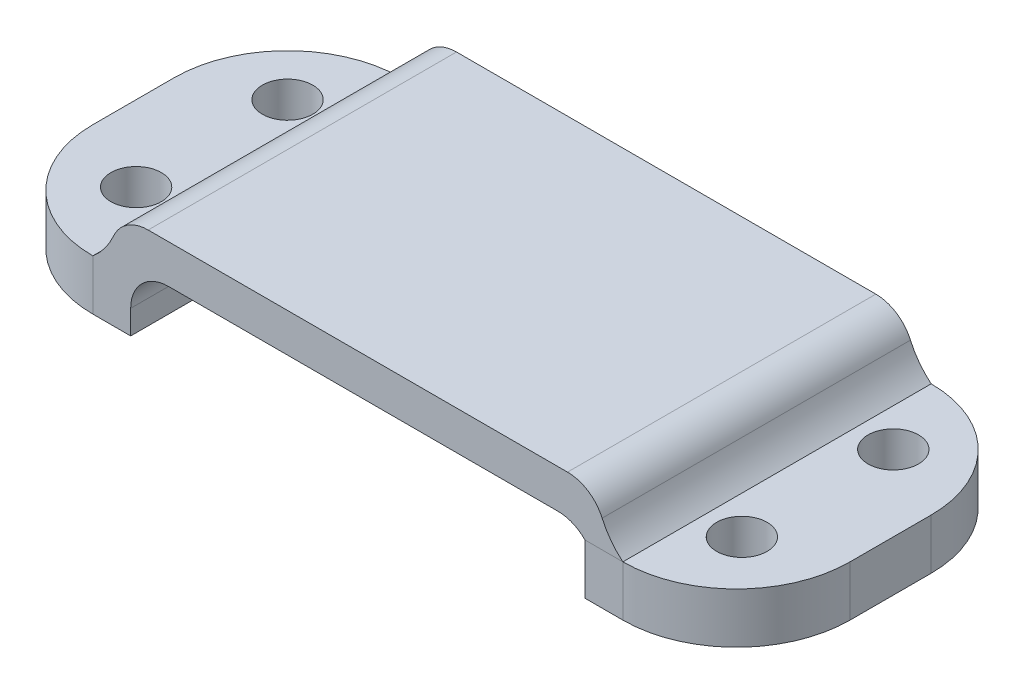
ISO-10303-21;
HEADER;
FILE_DESCRIPTION(('STEP AP214'),'2;1');
FILE_NAME('part.step','',(''),(''),'','','');
FILE_SCHEMA(('AUTOMOTIVE_DESIGN { 1 0 10303 214 1 1 1 1 }'));
ENDSEC;
DATA;
#1=APPLICATION_CONTEXT('core data for automotive mechanical design processes');
#2=APPLICATION_PROTOCOL_DEFINITION('international standard','automotive_design',2000,#1);
#3=PRODUCT_CONTEXT('',#1,'mechanical');
#4=PRODUCT('Part','Part','',(#3));
#5=PRODUCT_RELATED_PRODUCT_CATEGORY('part','',(#4));
#6=PRODUCT_DEFINITION_FORMATION('','',#4);
#7=PRODUCT_DEFINITION_CONTEXT('part definition',#1,'design');
#8=PRODUCT_DEFINITION('design','',#6,#7);
#9=PRODUCT_DEFINITION_SHAPE('','',#8);
#10=(LENGTH_UNIT() NAMED_UNIT(*) SI_UNIT(.MILLI.,.METRE.));
#11=(NAMED_UNIT(*) PLANE_ANGLE_UNIT() SI_UNIT($,.RADIAN.));
#12=(NAMED_UNIT(*) SI_UNIT($,.STERADIAN.) SOLID_ANGLE_UNIT());
#13=UNCERTAINTY_MEASURE_WITH_UNIT(LENGTH_MEASURE(1.E-05),#10,'distance_accuracy_value','');
#14=(GEOMETRIC_REPRESENTATION_CONTEXT(3) GLOBAL_UNCERTAINTY_ASSIGNED_CONTEXT((#13)) GLOBAL_UNIT_ASSIGNED_CONTEXT((#10,
#11,#12)) REPRESENTATION_CONTEXT('',''));
#15=CARTESIAN_POINT('',(0.,0.,0.));
#16=DIRECTION('',(0.,0.,1.));
#17=DIRECTION('',(1.,0.,0.));
#18=AXIS2_PLACEMENT_3D('',#15,#16,#17);
#19=CARTESIAN_POINT('',(0.,4.,-12.215));
#20=DIRECTION('',(0.,0.,1.));
#21=DIRECTION('',(1.,0.,0.));
#22=AXIS2_PLACEMENT_3D('',#19,#20,#21);
#23=PLANE('',#22);
#24=DIRECTION('',(-1.,0.,0.));
#25=VECTOR('',#24,1.);
#26=CARTESIAN_POINT('',(0.,4.,-12.215));
#27=LINE('',#26,#25);
#28=CARTESIAN_POINT('',(21.,4.,-12.215));
#29=VERTEX_POINT('',#28);
#30=CARTESIAN_POINT('',(18.,4.,-12.215));
#31=VERTEX_POINT('',#30);
#32=EDGE_CURVE('E110',#29,#31,#27,.T.);
#33=ORIENTED_EDGE('',*,*,#32,.F.);
#34=DIRECTION('',(0.,-1.,0.));
#35=VECTOR('',#34,1.);
#36=CARTESIAN_POINT('',(21.,4.,-12.215));
#37=LINE('',#36,#35);
#38=CARTESIAN_POINT('',(21.,0.,-12.215));
#39=VERTEX_POINT('',#38);
#40=EDGE_CURVE('E137',#29,#39,#37,.T.);
#41=ORIENTED_EDGE('',*,*,#40,.T.);
#42=DIRECTION('',(-1.,0.,0.));
#43=VECTOR('',#42,1.);
#44=CARTESIAN_POINT('',(0.,0.,-12.215));
#45=LINE('',#44,#43);
#46=CARTESIAN_POINT('',(18.,0.,-12.215));
#47=VERTEX_POINT('',#46);
#48=EDGE_CURVE('E134',#39,#47,#45,.T.);
#49=ORIENTED_EDGE('',*,*,#48,.T.);
#50=DIRECTION('',(0.,-1.,0.));
#51=VECTOR('',#50,1.);
#52=CARTESIAN_POINT('',(18.,4.,-12.215));
#53=LINE('',#52,#51);
#54=EDGE_CURVE('E127',#31,#47,#53,.T.);
#55=ORIENTED_EDGE('',*,*,#54,.F.);
#56=EDGE_LOOP('',(#33,#41,#49,#55));
#57=FACE_BOUND('',#56,.T.);
#58=ADVANCED_FACE('F55',(#57),#23,.F.);
#59=CARTESIAN_POINT('',(18.,4.,0.));
#60=DIRECTION('',(1.,0.,0.));
#61=DIRECTION('',(0.,0.,-1.));
#62=AXIS2_PLACEMENT_3D('',#59,#60,#61);
#63=PLANE('',#62);
#64=DIRECTION('',(0.,0.,1.));
#65=VECTOR('',#64,1.);
#66=CARTESIAN_POINT('',(18.,0.,0.));
#67=LINE('',#66,#65);
#68=CARTESIAN_POINT('',(18.,0.,12.215));
#69=VERTEX_POINT('',#68);
#70=EDGE_CURVE('E174',#47,#69,#67,.T.);
#71=ORIENTED_EDGE('',*,*,#70,.T.);
#72=DIRECTION('',(0.,-1.,0.));
#73=VECTOR('',#72,1.);
#74=CARTESIAN_POINT('',(18.,4.,12.215));
#75=LINE('',#74,#73);
#76=CARTESIAN_POINT('',(18.,4.,12.215));
#77=VERTEX_POINT('',#76);
#78=EDGE_CURVE('E129',#77,#69,#75,.T.);
#79=ORIENTED_EDGE('',*,*,#78,.F.);
#80=DIRECTION('',(0.,0.,1.));
#81=VECTOR('',#80,1.);
#82=CARTESIAN_POINT('',(18.,4.,0.));
#83=LINE('',#82,#81);
#84=EDGE_CURVE('E113',#31,#77,#83,.T.);
#85=ORIENTED_EDGE('',*,*,#84,.F.);
#86=ORIENTED_EDGE('',*,*,#54,.T.);
#87=EDGE_LOOP('',(#71,#79,#85,#86));
#88=FACE_BOUND('',#87,.T.);
#89=ADVANCED_FACE('F126',(#88),#63,.F.);
#90=CARTESIAN_POINT('',(0.,4.,12.215));
#91=DIRECTION('',(0.,0.,1.));
#92=DIRECTION('',(1.,0.,0.));
#93=AXIS2_PLACEMENT_3D('',#90,#91,#92);
#94=PLANE('',#93);
#95=DIRECTION('',(-1.,0.,0.));
#96=VECTOR('',#95,1.);
#97=CARTESIAN_POINT('',(0.,0.,12.215));
#98=LINE('',#97,#96);
#99=CARTESIAN_POINT('',(21.,0.,12.215));
#100=VERTEX_POINT('',#99);
#101=EDGE_CURVE('E164',#100,#69,#98,.T.);
#102=ORIENTED_EDGE('',*,*,#101,.F.);
#103=DIRECTION('',(0.,-1.,0.));
#104=VECTOR('',#103,1.);
#105=CARTESIAN_POINT('',(21.,4.,12.215));
#106=LINE('',#105,#104);
#107=CARTESIAN_POINT('',(21.,4.,12.215));
#108=VERTEX_POINT('',#107);
#109=EDGE_CURVE('E12',#100,#108,#106,.F.);
#110=ORIENTED_EDGE('',*,*,#109,.T.);
#111=DIRECTION('',(-1.,0.,0.));
#112=VECTOR('',#111,1.);
#113=CARTESIAN_POINT('',(0.,4.,12.215));
#114=LINE('',#113,#112);
#115=EDGE_CURVE('E131',#108,#77,#114,.T.);
#116=ORIENTED_EDGE('',*,*,#115,.T.);
#117=ORIENTED_EDGE('',*,*,#78,.T.);
#118=EDGE_LOOP('',(#102,#110,#116,#117));
#119=FACE_BOUND('',#118,.T.);
#120=ADVANCED_FACE('F193',(#119),#94,.T.);
#121=CARTESIAN_POINT('',(30.,4.,0.));
#122=DIRECTION('',(-1.,0.,0.));
#123=DIRECTION('',(0.,0.,1.));
#124=AXIS2_PLACEMENT_3D('',#121,#122,#123);
#125=PLANE('',#124);
#126=DIRECTION('',(0.,0.,-1.));
#127=VECTOR('',#126,1.);
#128=CARTESIAN_POINT('',(30.,0.,0.));
#129=LINE('',#128,#127);
#130=CARTESIAN_POINT('',(30.,0.,3.215));
#131=VERTEX_POINT('',#130);
#132=CARTESIAN_POINT('',(30.,0.,-3.215));
#133=VERTEX_POINT('',#132);
#134=EDGE_CURVE('E121',#131,#133,#129,.T.);
#135=ORIENTED_EDGE('',*,*,#134,.T.);
#136=DIRECTION('',(0.,-1.,0.));
#137=VECTOR('',#136,1.);
#138=CARTESIAN_POINT('',(30.,4.,-3.215));
#139=LINE('',#138,#137);
#140=CARTESIAN_POINT('',(30.,4.,-3.215));
#141=VERTEX_POINT('',#140);
#142=EDGE_CURVE('E77',#133,#141,#139,.F.);
#143=ORIENTED_EDGE('',*,*,#142,.T.);
#144=DIRECTION('',(0.,0.,-1.));
#145=VECTOR('',#144,1.);
#146=CARTESIAN_POINT('',(30.,4.,0.));
#147=LINE('',#146,#145);
#148=CARTESIAN_POINT('',(30.,4.,3.215));
#149=VERTEX_POINT('',#148);
#150=EDGE_CURVE('E144',#149,#141,#147,.T.);
#151=ORIENTED_EDGE('',*,*,#150,.F.);
#152=DIRECTION('',(0.,-1.,0.));
#153=VECTOR('',#152,1.);
#154=CARTESIAN_POINT('',(30.,0.,3.215));
#155=LINE('',#154,#153);
#156=EDGE_CURVE('E153',#149,#131,#155,.T.);
#157=ORIENTED_EDGE('',*,*,#156,.T.);
#158=EDGE_LOOP('',(#135,#143,#151,#157));
#159=FACE_BOUND('',#158,.T.);
#160=ADVANCED_FACE('F197',(#159),#125,.F.);
#161=CARTESIAN_POINT('',(0.,4.,0.));
#162=DIRECTION('',(0.,1.,0.));
#163=DIRECTION('',(0.,0.,1.));
#164=AXIS2_PLACEMENT_3D('',#161,#162,#163);
#165=PLANE('',#164);
#166=CARTESIAN_POINT('',(24.,4.,-6.21499999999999));
#167=DIRECTION('',(0.,1.,0.));
#168=DIRECTION('',(0.,0.,1.));
#169=AXIS2_PLACEMENT_3D('',#166,#167,#168);
#170=CIRCLE('',#169,2.);
#171=CARTESIAN_POINT('',(24.,4.,-4.21499999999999));
#172=VERTEX_POINT('',#171);
#173=EDGE_CURVE('E168',#172,#172,#170,.T.);
#174=ORIENTED_EDGE('',*,*,#173,.F.);
#175=EDGE_LOOP('',(#174));
#176=FACE_BOUND('',#175,.T.);
#177=CARTESIAN_POINT('',(24.0000000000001,4.,5.78500000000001));
#178=DIRECTION('',(0.,1.,0.));
#179=DIRECTION('',(0.,0.,1.));
#180=AXIS2_PLACEMENT_3D('',#177,#178,#179);
#181=CIRCLE('',#180,2.);
#182=CARTESIAN_POINT('',(24.0000000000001,4.,7.78500000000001));
#183=VERTEX_POINT('',#182);
#184=EDGE_CURVE('E178',#183,#183,#181,.T.);
#185=ORIENTED_EDGE('',*,*,#184,.F.);
#186=EDGE_LOOP('',(#185));
#187=FACE_BOUND('',#186,.T.);
#188=ORIENTED_EDGE('',*,*,#150,.T.);
#189=CARTESIAN_POINT('',(21.,4.,-3.215));
#190=DIRECTION('',(0.,1.,0.));
#191=DIRECTION('',(0.,0.,1.));
#192=AXIS2_PLACEMENT_3D('',#189,#190,#191);
#193=CIRCLE('',#192,9.);
#194=EDGE_CURVE('E64',#141,#29,#193,.T.);
#195=ORIENTED_EDGE('',*,*,#194,.T.);
#196=ORIENTED_EDGE('',*,*,#32,.T.);
#197=ORIENTED_EDGE('',*,*,#84,.T.);
#198=ORIENTED_EDGE('',*,*,#115,.F.);
#199=CARTESIAN_POINT('',(21.,4.,3.215));
#200=DIRECTION('',(0.,1.,0.));
#201=DIRECTION('',(0.,0.,1.));
#202=AXIS2_PLACEMENT_3D('',#199,#200,#201);
#203=CIRCLE('',#202,9.);
#204=EDGE_CURVE('E159',#108,#149,#203,.T.);
#205=ORIENTED_EDGE('',*,*,#204,.T.);
#206=EDGE_LOOP('',(#188,#195,#196,#197,#198,#205));
#207=FACE_BOUND('',#206,.T.);
#208=ADVANCED_FACE('F112',(#176,#187,#207),#165,.T.);
#209=CARTESIAN_POINT('',(0.,0.,0.));
#210=DIRECTION('',(0.,1.,0.));
#211=DIRECTION('',(0.,0.,1.));
#212=AXIS2_PLACEMENT_3D('',#209,#210,#211);
#213=PLANE('',#212);
#214=CARTESIAN_POINT('',(24.,0.,-6.21499999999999));
#215=DIRECTION('',(0.,1.,0.));
#216=DIRECTION('',(0.,0.,1.));
#217=AXIS2_PLACEMENT_3D('',#214,#215,#216);
#218=CIRCLE('',#217,2.);
#219=CARTESIAN_POINT('',(24.,0.,-4.21499999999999));
#220=VERTEX_POINT('',#219);
#221=EDGE_CURVE('E170',#220,#220,#218,.T.);
#222=ORIENTED_EDGE('',*,*,#221,.T.);
#223=EDGE_LOOP('',(#222));
#224=FACE_BOUND('',#223,.T.);
#225=CARTESIAN_POINT('',(24.0000000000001,0.,5.78500000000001));
#226=DIRECTION('',(0.,1.,0.));
#227=DIRECTION('',(0.,0.,1.));
#228=AXIS2_PLACEMENT_3D('',#225,#226,#227);
#229=CIRCLE('',#228,2.);
#230=CARTESIAN_POINT('',(24.0000000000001,0.,7.78500000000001));
#231=VERTEX_POINT('',#230);
#232=EDGE_CURVE('E171',#231,#231,#229,.T.);
#233=ORIENTED_EDGE('',*,*,#232,.T.);
#234=EDGE_LOOP('',(#233));
#235=FACE_BOUND('',#234,.T.);
#236=ORIENTED_EDGE('',*,*,#48,.F.);
#237=CARTESIAN_POINT('',(21.,0.,-3.215));
#238=DIRECTION('',(0.,1.,0.));
#239=DIRECTION('',(0.,0.,1.));
#240=AXIS2_PLACEMENT_3D('',#237,#238,#239);
#241=CIRCLE('',#240,9.);
#242=EDGE_CURVE('E150',#39,#133,#241,.F.);
#243=ORIENTED_EDGE('',*,*,#242,.T.);
#244=ORIENTED_EDGE('',*,*,#134,.F.);
#245=CARTESIAN_POINT('',(21.,0.,3.215));
#246=DIRECTION('',(0.,1.,0.));
#247=DIRECTION('',(0.,0.,1.));
#248=AXIS2_PLACEMENT_3D('',#245,#246,#247);
#249=CIRCLE('',#248,9.);
#250=EDGE_CURVE('E141',#131,#100,#249,.F.);
#251=ORIENTED_EDGE('',*,*,#250,.T.);
#252=ORIENTED_EDGE('',*,*,#101,.T.);
#253=ORIENTED_EDGE('',*,*,#70,.F.);
#254=EDGE_LOOP('',(#236,#243,#244,#251,#252,#253));
#255=FACE_BOUND('',#254,.T.);
#256=ADVANCED_FACE('F191',(#224,#235,#255),#213,.F.);
#257=CARTESIAN_POINT('',(24.0000000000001,0.,5.78500000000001));
#258=DIRECTION('',(0.,1.,0.));
#259=DIRECTION('',(0.,0.,1.));
#260=AXIS2_PLACEMENT_3D('',#257,#258,#259);
#261=CYLINDRICAL_SURFACE('',#260,2.);
#262=ORIENTED_EDGE('',*,*,#232,.F.);
#263=EDGE_LOOP('',(#262));
#264=FACE_BOUND('',#263,.T.);
#265=ORIENTED_EDGE('',*,*,#184,.T.);
#266=EDGE_LOOP('',(#265));
#267=FACE_BOUND('',#266,.T.);
#268=ADVANCED_FACE('F206',(#264,#267),#261,.F.);
#269=CARTESIAN_POINT('',(24.,0.,-6.21499999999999));
#270=DIRECTION('',(0.,1.,0.));
#271=DIRECTION('',(0.,0.,1.));
#272=AXIS2_PLACEMENT_3D('',#269,#270,#271);
#273=CYLINDRICAL_SURFACE('',#272,2.);
#274=ORIENTED_EDGE('',*,*,#221,.F.);
#275=EDGE_LOOP('',(#274));
#276=FACE_BOUND('',#275,.T.);
#277=ORIENTED_EDGE('',*,*,#173,.T.);
#278=EDGE_LOOP('',(#277));
#279=FACE_BOUND('',#278,.T.);
#280=ADVANCED_FACE('F201',(#276,#279),#273,.F.);
#281=CARTESIAN_POINT('',(21.,4.,-3.215));
#282=DIRECTION('',(0.,-1.,0.));
#283=DIRECTION('',(0.,0.,-1.));
#284=AXIS2_PLACEMENT_3D('',#281,#282,#283);
#285=CYLINDRICAL_SURFACE('',#284,9.);
#286=ORIENTED_EDGE('',*,*,#194,.F.);
#287=ORIENTED_EDGE('',*,*,#142,.F.);
#288=ORIENTED_EDGE('',*,*,#242,.F.);
#289=ORIENTED_EDGE('',*,*,#40,.F.);
#290=EDGE_LOOP('',(#286,#287,#288,#289));
#291=FACE_BOUND('',#290,.T.);
#292=ADVANCED_FACE('F199',(#291),#285,.T.);
#293=CARTESIAN_POINT('',(21.,4.,3.215));
#294=DIRECTION('',(0.,1.,0.));
#295=DIRECTION('',(0.,0.,1.));
#296=AXIS2_PLACEMENT_3D('',#293,#294,#295);
#297=CYLINDRICAL_SURFACE('',#296,9.);
#298=ORIENTED_EDGE('',*,*,#204,.F.);
#299=ORIENTED_EDGE('',*,*,#109,.F.);
#300=ORIENTED_EDGE('',*,*,#250,.F.);
#301=ORIENTED_EDGE('',*,*,#156,.F.);
#302=EDGE_LOOP('',(#298,#299,#300,#301));
#303=FACE_BOUND('',#302,.T.);
#304=ADVANCED_FACE('F57',(#303),#297,.T.);
#305=CLOSED_SHELL('',(#58,#89,#120,#160,#208,#256,#268,#280,#292,#304));
#306=MANIFOLD_SOLID_BREP('B2',#305);
#307=CARTESIAN_POINT('',(0.,4.,0.));
#308=DIRECTION('',(0.,1.,0.));
#309=DIRECTION('',(0.,0.,1.));
#310=AXIS2_PLACEMENT_3D('',#307,#308,#309);
#311=PLANE('',#310);
#312=CARTESIAN_POINT('',(-24.,4.,-6.21499999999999));
#313=DIRECTION('',(0.,1.,0.));
#314=DIRECTION('',(0.,0.,1.));
#315=AXIS2_PLACEMENT_3D('',#312,#313,#314);
#316=CIRCLE('',#315,2.);
#317=CARTESIAN_POINT('',(-24.,4.,-4.21499999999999));
#318=VERTEX_POINT('',#317);
#319=EDGE_CURVE('E473',#318,#318,#316,.T.);
#320=ORIENTED_EDGE('',*,*,#319,.F.);
#321=EDGE_LOOP('',(#320));
#322=FACE_BOUND('',#321,.T.);
#323=CARTESIAN_POINT('',(-23.9999999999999,4.,5.78500000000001));
#324=DIRECTION('',(0.,1.,0.));
#325=DIRECTION('',(0.,0.,1.));
#326=AXIS2_PLACEMENT_3D('',#323,#324,#325);
#327=CIRCLE('',#326,2.);
#328=CARTESIAN_POINT('',(-23.9999999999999,4.,7.78500000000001));
#329=VERTEX_POINT('',#328);
#330=EDGE_CURVE('E461',#329,#329,#327,.T.);
#331=ORIENTED_EDGE('',*,*,#330,.F.);
#332=EDGE_LOOP('',(#331));
#333=FACE_BOUND('',#332,.T.);
#334=CARTESIAN_POINT('',(-21.,4.,3.21499999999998));
#335=DIRECTION('',(0.,1.,0.));
#336=DIRECTION('',(0.,0.,1.));
#337=AXIS2_PLACEMENT_3D('',#334,#335,#336);
#338=CIRCLE('',#337,9.);
#339=CARTESIAN_POINT('',(-30.,4.,3.21499999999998));
#340=VERTEX_POINT('',#339);
#341=CARTESIAN_POINT('',(-21.,4.,12.215));
#342=VERTEX_POINT('',#341);
#343=EDGE_CURVE('E529',#340,#342,#338,.T.);
#344=ORIENTED_EDGE('',*,*,#343,.T.);
#345=DIRECTION('',(0.,0.,-1.));
#346=VECTOR('',#345,1.);
#347=CARTESIAN_POINT('',(-21.,4.,33.5861188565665));
#348=LINE('',#347,#346);
#349=CARTESIAN_POINT('',(-21.,4.,-12.215));
#350=VERTEX_POINT('',#349);
#351=EDGE_CURVE('E452',#342,#350,#348,.T.);
#352=ORIENTED_EDGE('',*,*,#351,.T.);
#353=CARTESIAN_POINT('',(-21.,4.,-3.21499999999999));
#354=DIRECTION('',(0.,1.,0.));
#355=DIRECTION('',(0.,0.,1.));
#356=AXIS2_PLACEMENT_3D('',#353,#354,#355);
#357=CIRCLE('',#356,9.);
#358=CARTESIAN_POINT('',(-30.,4.,-3.21499999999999));
#359=VERTEX_POINT('',#358);
#360=EDGE_CURVE('E526',#350,#359,#357,.T.);
#361=ORIENTED_EDGE('',*,*,#360,.T.);
#362=DIRECTION('',(0.,0.,-1.));
#363=VECTOR('',#362,1.);
#364=CARTESIAN_POINT('',(-30.,4.,0.));
#365=LINE('',#364,#363);
#366=EDGE_CURVE('E484',#340,#359,#365,.T.);
#367=ORIENTED_EDGE('',*,*,#366,.F.);
#368=EDGE_LOOP('',(#344,#352,#361,#367));
#369=FACE_BOUND('',#368,.T.);
#370=ADVANCED_FACE('F314',(#322,#333,#369),#311,.T.);
#371=CARTESIAN_POINT('',(-18.,4.,0.));
#372=DIRECTION('',(1.,0.,0.));
#373=DIRECTION('',(0.,0.,-1.));
#374=AXIS2_PLACEMENT_3D('',#371,#372,#373);
#375=PLANE('',#374);
#376=DIRECTION('',(0.,-1.,0.));
#377=VECTOR('',#376,1.);
#378=CARTESIAN_POINT('',(-18.,4.,-12.215));
#379=LINE('',#378,#377);
#380=CARTESIAN_POINT('',(-18.,1.9,-12.215));
#381=VERTEX_POINT('',#380);
#382=CARTESIAN_POINT('',(-18.,0.,-12.215));
#383=VERTEX_POINT('',#382);
#384=EDGE_CURVE('E506',#381,#383,#379,.T.);
#385=ORIENTED_EDGE('',*,*,#384,.F.);
#386=DIRECTION('',(0.,0.,-1.));
#387=VECTOR('',#386,1.);
#388=CARTESIAN_POINT('',(-18.,1.9,0.));
#389=LINE('',#388,#387);
#390=CARTESIAN_POINT('',(-18.,1.9,12.215));
#391=VERTEX_POINT('',#390);
#392=EDGE_CURVE('E561',#381,#391,#389,.F.);
#393=ORIENTED_EDGE('',*,*,#392,.T.);
#394=DIRECTION('',(0.,-1.,0.));
#395=VECTOR('',#394,1.);
#396=CARTESIAN_POINT('',(-18.,4.,12.215));
#397=LINE('',#396,#395);
#398=CARTESIAN_POINT('',(-18.,0.,12.215));
#399=VERTEX_POINT('',#398);
#400=EDGE_CURVE('E488',#391,#399,#397,.T.);
#401=ORIENTED_EDGE('',*,*,#400,.T.);
#402=DIRECTION('',(0.,0.,1.));
#403=VECTOR('',#402,1.);
#404=CARTESIAN_POINT('',(-18.,0.,0.));
#405=LINE('',#404,#403);
#406=EDGE_CURVE('E472',#383,#399,#405,.T.);
#407=ORIENTED_EDGE('',*,*,#406,.F.);
#408=EDGE_LOOP('',(#385,#393,#401,#407));
#409=FACE_BOUND('',#408,.T.);
#410=ADVANCED_FACE('F648',(#409),#375,.T.);
#411=CARTESIAN_POINT('',(0.,4.,-12.215));
#412=DIRECTION('',(0.,0.,1.));
#413=DIRECTION('',(1.,0.,0.));
#414=AXIS2_PLACEMENT_3D('',#411,#412,#413);
#415=PLANE('',#414);
#416=DIRECTION('',(-1.,0.,0.));
#417=VECTOR('',#416,1.);
#418=CARTESIAN_POINT('',(0.,7.96544085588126,-12.215));
#419=LINE('',#418,#417);
#420=CARTESIAN_POINT('',(16.6146747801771,7.96544085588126,-12.215));
#421=VERTEX_POINT('',#420);
#422=CARTESIAN_POINT('',(-16.6146747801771,7.96544085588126,-12.215));
#423=VERTEX_POINT('',#422);
#424=EDGE_CURVE('E453',#421,#423,#419,.T.);
#425=ORIENTED_EDGE('',*,*,#424,.F.);
#426=CARTESIAN_POINT('',(16.6146747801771,4.96544085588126,-12.215));
#427=DIRECTION('',(0.,0.,1.));
#428=DIRECTION('',(1.,0.,0.));
#429=AXIS2_PLACEMENT_3D('',#426,#427,#428);
#430=CIRCLE('',#429,3.);
#431=CARTESIAN_POINT('',(19.3583570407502,6.17878650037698,-12.215));
#432=VERTEX_POINT('',#431);
#433=EDGE_CURVE('E419',#421,#432,#430,.F.);
#434=ORIENTED_EDGE('',*,*,#433,.T.);
#435=CARTESIAN_POINT('',(24.8457215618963,8.60547778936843,-12.215));
#436=DIRECTION('',(0.,0.,1.));
#437=DIRECTION('',(1.,0.,0.));
#438=AXIS2_PLACEMENT_3D('',#435,#436,#437);
#439=CIRCLE('',#438,6.);
#440=CARTESIAN_POINT('',(21.,4.,-12.215));
#441=VERTEX_POINT('',#440);
#442=EDGE_CURVE('E414',#432,#441,#439,.T.);
#443=ORIENTED_EDGE('',*,*,#442,.T.);
#444=DIRECTION('',(-1.,0.,0.));
#445=VECTOR('',#444,1.);
#446=CARTESIAN_POINT('',(0.,4.,-12.215));
#447=LINE('',#446,#445);
#448=CARTESIAN_POINT('',(18.,4.,-12.215));
#449=VERTEX_POINT('',#448);
#450=EDGE_CURVE('E418',#441,#449,#447,.T.);
#451=ORIENTED_EDGE('',*,*,#450,.T.);
#452=CARTESIAN_POINT('',(15.8575714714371,1.9,-12.215));
#453=DIRECTION('',(0.,0.,1.));
#454=DIRECTION('',(1.,0.,0.));
#455=AXIS2_PLACEMENT_3D('',#452,#453,#454);
#456=CIRCLE('',#455,3.);
#457=CARTESIAN_POINT('',(15.8575714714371,4.9,-12.215));
#458=VERTEX_POINT('',#457);
#459=EDGE_CURVE('E564',#449,#458,#456,.T.);
#460=ORIENTED_EDGE('',*,*,#459,.T.);
#461=DIRECTION('',(-1.,0.,0.));
#462=VECTOR('',#461,1.);
#463=CARTESIAN_POINT('',(0.,4.9,-12.215));
#464=LINE('',#463,#462);
#465=CARTESIAN_POINT('',(-15.,4.9,-12.215));
#466=VERTEX_POINT('',#465);
#467=EDGE_CURVE('E449',#458,#466,#464,.T.);
#468=ORIENTED_EDGE('',*,*,#467,.T.);
#469=CARTESIAN_POINT('',(-15.,1.9,-12.215));
#470=DIRECTION('',(0.,0.,1.));
#471=DIRECTION('',(1.,0.,0.));
#472=AXIS2_PLACEMENT_3D('',#469,#470,#471);
#473=CIRCLE('',#472,3.);
#474=EDGE_CURVE('E570',#466,#381,#473,.T.);
#475=ORIENTED_EDGE('',*,*,#474,.T.);
#476=ORIENTED_EDGE('',*,*,#384,.T.);
#477=DIRECTION('',(-1.,0.,0.));
#478=VECTOR('',#477,1.);
#479=CARTESIAN_POINT('',(0.,0.,-12.215));
#480=LINE('',#479,#478);
#481=CARTESIAN_POINT('',(-21.,0.,-12.215));
#482=VERTEX_POINT('',#481);
#483=EDGE_CURVE('E493',#383,#482,#480,.T.);
#484=ORIENTED_EDGE('',*,*,#483,.T.);
#485=DIRECTION('',(0.,-1.,0.));
#486=VECTOR('',#485,1.);
#487=CARTESIAN_POINT('',(-21.,4.,-12.215));
#488=LINE('',#487,#486);
#489=EDGE_CURVE('E533',#482,#350,#488,.F.);
#490=ORIENTED_EDGE('',*,*,#489,.T.);
#491=CARTESIAN_POINT('',(-24.8457215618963,8.60547778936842,-12.215));
#492=DIRECTION('',(0.,0.,1.));
#493=DIRECTION('',(1.,0.,0.));
#494=AXIS2_PLACEMENT_3D('',#491,#492,#493);
#495=CIRCLE('',#494,6.);
#496=CARTESIAN_POINT('',(-19.3583570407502,6.17878650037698,-12.215));
#497=VERTEX_POINT('',#496);
#498=EDGE_CURVE('E323',#350,#497,#495,.T.);
#499=ORIENTED_EDGE('',*,*,#498,.T.);
#500=CARTESIAN_POINT('',(-16.6146747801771,4.96544085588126,-12.215));
#501=DIRECTION('',(0.,0.,1.));
#502=DIRECTION('',(1.,0.,0.));
#503=AXIS2_PLACEMENT_3D('',#500,#501,#502);
#504=CIRCLE('',#503,3.);
#505=EDGE_CURVE('E543',#497,#423,#504,.F.);
#506=ORIENTED_EDGE('',*,*,#505,.T.);
#507=EDGE_LOOP('',(#425,#434,#443,#451,#460,#468,#475,#476,#484,#490,#499,#506));
#508=FACE_BOUND('',#507,.T.);
#509=ADVANCED_FACE('F417',(#508),#415,.F.);
#510=CARTESIAN_POINT('',(-30.,4.,0.));
#511=DIRECTION('',(-1.,0.,0.));
#512=DIRECTION('',(0.,0.,1.));
#513=AXIS2_PLACEMENT_3D('',#510,#511,#512);
#514=PLANE('',#513);
#515=DIRECTION('',(0.,0.,-1.));
#516=VECTOR('',#515,1.);
#517=CARTESIAN_POINT('',(-30.,0.,0.));
#518=LINE('',#517,#516);
#519=CARTESIAN_POINT('',(-30.,0.,3.21499999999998));
#520=VERTEX_POINT('',#519);
#521=CARTESIAN_POINT('',(-30.,0.,-3.21499999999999));
#522=VERTEX_POINT('',#521);
#523=EDGE_CURVE('E497',#520,#522,#518,.T.);
#524=ORIENTED_EDGE('',*,*,#523,.F.);
#525=DIRECTION('',(0.,-1.,0.));
#526=VECTOR('',#525,1.);
#527=CARTESIAN_POINT('',(-30.,4.,3.21499999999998));
#528=LINE('',#527,#526);
#529=EDGE_CURVE('E523',#520,#340,#528,.F.);
#530=ORIENTED_EDGE('',*,*,#529,.T.);
#531=ORIENTED_EDGE('',*,*,#366,.T.);
#532=DIRECTION('',(0.,-1.,0.));
#533=VECTOR('',#532,1.);
#534=CARTESIAN_POINT('',(-30.,0.,-3.21499999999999));
#535=LINE('',#534,#533);
#536=EDGE_CURVE('E519',#359,#522,#535,.T.);
#537=ORIENTED_EDGE('',*,*,#536,.T.);
#538=EDGE_LOOP('',(#524,#530,#531,#537));
#539=FACE_BOUND('',#538,.T.);
#540=ADVANCED_FACE('F664',(#539),#514,.T.);
#541=CARTESIAN_POINT('',(0.,4.,12.215));
#542=DIRECTION('',(0.,0.,-1.));
#543=DIRECTION('',(-1.,0.,0.));
#544=AXIS2_PLACEMENT_3D('',#541,#542,#543);
#545=PLANE('',#544);
#546=DIRECTION('',(-1.,0.,0.));
#547=VECTOR('',#546,1.);
#548=CARTESIAN_POINT('',(0.,4.,12.215));
#549=LINE('',#548,#547);
#550=CARTESIAN_POINT('',(21.,4.,12.215));
#551=VERTEX_POINT('',#550);
#552=CARTESIAN_POINT('',(18.,4.,12.215));
#553=VERTEX_POINT('',#552);
#554=EDGE_CURVE('E445',#551,#553,#549,.T.);
#555=ORIENTED_EDGE('',*,*,#554,.F.);
#556=CARTESIAN_POINT('',(24.8457215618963,8.60547778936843,12.215));
#557=DIRECTION('',(0.,0.,-1.));
#558=DIRECTION('',(-1.,0.,0.));
#559=AXIS2_PLACEMENT_3D('',#556,#557,#558);
#560=CIRCLE('',#559,6.);
#561=CARTESIAN_POINT('',(19.3583570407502,6.17878650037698,12.215));
#562=VERTEX_POINT('',#561);
#563=EDGE_CURVE('E425',#551,#562,#560,.T.);
#564=ORIENTED_EDGE('',*,*,#563,.T.);
#565=CARTESIAN_POINT('',(16.6146747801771,4.96544085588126,12.215));
#566=DIRECTION('',(0.,0.,-1.));
#567=DIRECTION('',(-1.,0.,0.));
#568=AXIS2_PLACEMENT_3D('',#565,#566,#567);
#569=CIRCLE('',#568,3.);
#570=CARTESIAN_POINT('',(16.6146747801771,7.96544085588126,12.215));
#571=VERTEX_POINT('',#570);
#572=EDGE_CURVE('E551',#562,#571,#569,.F.);
#573=ORIENTED_EDGE('',*,*,#572,.T.);
#574=DIRECTION('',(-1.,0.,0.));
#575=VECTOR('',#574,1.);
#576=CARTESIAN_POINT('',(0.,7.96544085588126,12.215));
#577=LINE('',#576,#575);
#578=CARTESIAN_POINT('',(-16.6146747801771,7.96544085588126,12.215));
#579=VERTEX_POINT('',#578);
#580=EDGE_CURVE('E457',#571,#579,#577,.T.);
#581=ORIENTED_EDGE('',*,*,#580,.T.);
#582=CARTESIAN_POINT('',(-16.6146747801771,4.96544085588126,12.215));
#583=DIRECTION('',(0.,0.,-1.));
#584=DIRECTION('',(-1.,0.,0.));
#585=AXIS2_PLACEMENT_3D('',#582,#583,#584);
#586=CIRCLE('',#585,3.);
#587=CARTESIAN_POINT('',(-19.3583570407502,6.17878650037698,12.215));
#588=VERTEX_POINT('',#587);
#589=EDGE_CURVE('E548',#579,#588,#586,.F.);
#590=ORIENTED_EDGE('',*,*,#589,.T.);
#591=CARTESIAN_POINT('',(-24.8457215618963,8.60547778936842,12.215));
#592=DIRECTION('',(0.,0.,-1.));
#593=DIRECTION('',(-1.,0.,0.));
#594=AXIS2_PLACEMENT_3D('',#591,#592,#593);
#595=CIRCLE('',#594,6.);
#596=EDGE_CURVE('E53',#588,#342,#595,.T.);
#597=ORIENTED_EDGE('',*,*,#596,.T.);
#598=DIRECTION('',(0.,-1.,0.));
#599=VECTOR('',#598,1.);
#600=CARTESIAN_POINT('',(-21.,0.,12.215));
#601=LINE('',#600,#599);
#602=CARTESIAN_POINT('',(-21.,0.,12.215));
#603=VERTEX_POINT('',#602);
#604=EDGE_CURVE('E509',#342,#603,#601,.T.);
#605=ORIENTED_EDGE('',*,*,#604,.T.);
#606=DIRECTION('',(1.,0.,0.));
#607=VECTOR('',#606,1.);
#608=CARTESIAN_POINT('',(0.,0.,12.215));
#609=LINE('',#608,#607);
#610=EDGE_CURVE('E489',#603,#399,#609,.T.);
#611=ORIENTED_EDGE('',*,*,#610,.T.);
#612=ORIENTED_EDGE('',*,*,#400,.F.);
#613=CARTESIAN_POINT('',(-15.,1.9,12.215));
#614=DIRECTION('',(0.,0.,-1.));
#615=DIRECTION('',(-1.,0.,0.));
#616=AXIS2_PLACEMENT_3D('',#613,#614,#615);
#617=CIRCLE('',#616,3.);
#618=CARTESIAN_POINT('',(-15.,4.9,12.215));
#619=VERTEX_POINT('',#618);
#620=EDGE_CURVE('E573',#391,#619,#617,.T.);
#621=ORIENTED_EDGE('',*,*,#620,.T.);
#622=DIRECTION('',(-1.,0.,0.));
#623=VECTOR('',#622,1.);
#624=CARTESIAN_POINT('',(0.,4.9,12.215));
#625=LINE('',#624,#623);
#626=CARTESIAN_POINT('',(15.8575714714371,4.9,12.215));
#627=VERTEX_POINT('',#626);
#628=EDGE_CURVE('E462',#627,#619,#625,.T.);
#629=ORIENTED_EDGE('',*,*,#628,.F.);
#630=CARTESIAN_POINT('',(15.8575714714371,1.9,12.215));
#631=DIRECTION('',(0.,0.,-1.));
#632=DIRECTION('',(-1.,0.,0.));
#633=AXIS2_PLACEMENT_3D('',#630,#631,#632);
#634=CIRCLE('',#633,3.);
#635=EDGE_CURVE('E567',#627,#553,#634,.T.);
#636=ORIENTED_EDGE('',*,*,#635,.T.);
#637=EDGE_LOOP('',(#555,#564,#573,#581,#590,#597,#605,#611,#612,#621,#629,#636));
#638=FACE_BOUND('',#637,.T.);
#639=ADVANCED_FACE('F671',(#638),#545,.F.);
#640=CARTESIAN_POINT('',(0.,0.,0.));
#641=DIRECTION('',(0.,1.,0.));
#642=DIRECTION('',(0.,0.,1.));
#643=AXIS2_PLACEMENT_3D('',#640,#641,#642);
#644=PLANE('',#643);
#645=CARTESIAN_POINT('',(-24.,0.,-6.21499999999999));
#646=DIRECTION('',(0.,1.,0.));
#647=DIRECTION('',(0.,0.,1.));
#648=AXIS2_PLACEMENT_3D('',#645,#646,#647);
#649=CIRCLE('',#648,2.);
#650=CARTESIAN_POINT('',(-24.,0.,-4.21499999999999));
#651=VERTEX_POINT('',#650);
#652=EDGE_CURVE('E468',#651,#651,#649,.T.);
#653=ORIENTED_EDGE('',*,*,#652,.T.);
#654=EDGE_LOOP('',(#653));
#655=FACE_BOUND('',#654,.T.);
#656=CARTESIAN_POINT('',(-23.9999999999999,0.,5.78500000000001));
#657=DIRECTION('',(0.,1.,0.));
#658=DIRECTION('',(0.,0.,1.));
#659=AXIS2_PLACEMENT_3D('',#656,#657,#658);
#660=CIRCLE('',#659,2.);
#661=CARTESIAN_POINT('',(-23.9999999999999,0.,7.78500000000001));
#662=VERTEX_POINT('',#661);
#663=EDGE_CURVE('E477',#662,#662,#660,.T.);
#664=ORIENTED_EDGE('',*,*,#663,.T.);
#665=EDGE_LOOP('',(#664));
#666=FACE_BOUND('',#665,.T.);
#667=ORIENTED_EDGE('',*,*,#610,.F.);
#668=CARTESIAN_POINT('',(-21.,0.,3.21499999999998));
#669=DIRECTION('',(0.,1.,0.));
#670=DIRECTION('',(0.,0.,1.));
#671=AXIS2_PLACEMENT_3D('',#668,#669,#670);
#672=CIRCLE('',#671,9.);
#673=EDGE_CURVE('E516',#603,#520,#672,.F.);
#674=ORIENTED_EDGE('',*,*,#673,.T.);
#675=ORIENTED_EDGE('',*,*,#523,.T.);
#676=CARTESIAN_POINT('',(-21.,0.,-3.21499999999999));
#677=DIRECTION('',(0.,1.,0.));
#678=DIRECTION('',(0.,0.,1.));
#679=AXIS2_PLACEMENT_3D('',#676,#677,#678);
#680=CIRCLE('',#679,9.);
#681=EDGE_CURVE('E513',#522,#482,#680,.F.);
#682=ORIENTED_EDGE('',*,*,#681,.T.);
#683=ORIENTED_EDGE('',*,*,#483,.F.);
#684=ORIENTED_EDGE('',*,*,#406,.T.);
#685=EDGE_LOOP('',(#667,#674,#675,#682,#683,#684));
#686=FACE_BOUND('',#685,.T.);
#687=ADVANCED_FACE('F652',(#655,#666,#686),#644,.F.);
#688=CARTESIAN_POINT('',(-23.9999999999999,0.,5.78500000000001));
#689=DIRECTION('',(0.,1.,0.));
#690=DIRECTION('',(0.,0.,1.));
#691=AXIS2_PLACEMENT_3D('',#688,#689,#690);
#692=CYLINDRICAL_SURFACE('',#691,2.);
#693=ORIENTED_EDGE('',*,*,#663,.F.);
#694=EDGE_LOOP('',(#693));
#695=FACE_BOUND('',#694,.T.);
#696=ORIENTED_EDGE('',*,*,#330,.T.);
#697=EDGE_LOOP('',(#696));
#698=FACE_BOUND('',#697,.T.);
#699=ADVANCED_FACE('F701',(#695,#698),#692,.F.);
#700=CARTESIAN_POINT('',(-24.,0.,-6.21499999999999));
#701=DIRECTION('',(0.,1.,0.));
#702=DIRECTION('',(0.,0.,1.));
#703=AXIS2_PLACEMENT_3D('',#700,#701,#702);
#704=CYLINDRICAL_SURFACE('',#703,2.);
#705=ORIENTED_EDGE('',*,*,#652,.F.);
#706=EDGE_LOOP('',(#705));
#707=FACE_BOUND('',#706,.T.);
#708=ORIENTED_EDGE('',*,*,#319,.T.);
#709=EDGE_LOOP('',(#708));
#710=FACE_BOUND('',#709,.T.);
#711=ADVANCED_FACE('F713',(#707,#710),#704,.F.);
#712=CARTESIAN_POINT('',(-21.,4.,3.21499999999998));
#713=DIRECTION('',(0.,1.,0.));
#714=DIRECTION('',(0.,0.,1.));
#715=AXIS2_PLACEMENT_3D('',#712,#713,#714);
#716=CYLINDRICAL_SURFACE('',#715,9.);
#717=ORIENTED_EDGE('',*,*,#343,.F.);
#718=ORIENTED_EDGE('',*,*,#529,.F.);
#719=ORIENTED_EDGE('',*,*,#673,.F.);
#720=ORIENTED_EDGE('',*,*,#604,.F.);
#721=EDGE_LOOP('',(#717,#718,#719,#720));
#722=FACE_BOUND('',#721,.T.);
#723=ADVANCED_FACE('F667',(#722),#716,.T.);
#724=CARTESIAN_POINT('',(-21.,4.,-3.21499999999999));
#725=DIRECTION('',(0.,1.,0.));
#726=DIRECTION('',(0.,0.,1.));
#727=AXIS2_PLACEMENT_3D('',#724,#725,#726);
#728=CYLINDRICAL_SURFACE('',#727,9.);
#729=ORIENTED_EDGE('',*,*,#360,.F.);
#730=ORIENTED_EDGE('',*,*,#489,.F.);
#731=ORIENTED_EDGE('',*,*,#681,.F.);
#732=ORIENTED_EDGE('',*,*,#536,.F.);
#733=EDGE_LOOP('',(#729,#730,#731,#732));
#734=FACE_BOUND('',#733,.T.);
#735=ADVANCED_FACE('F656',(#734),#728,.T.);
#736=CARTESIAN_POINT('',(0.,4.9,33.5861188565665));
#737=DIRECTION('',(0.,1.,0.));
#738=DIRECTION('',(0.,0.,1.));
#739=AXIS2_PLACEMENT_3D('',#736,#737,#738);
#740=PLANE('',#739);
#741=ORIENTED_EDGE('',*,*,#467,.F.);
#742=DIRECTION('',(0.,0.,-1.));
#743=VECTOR('',#742,1.);
#744=CARTESIAN_POINT('',(15.8575714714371,4.9,33.5861188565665));
#745=LINE('',#744,#743);
#746=EDGE_CURVE('E558',#458,#627,#745,.F.);
#747=ORIENTED_EDGE('',*,*,#746,.T.);
#748=ORIENTED_EDGE('',*,*,#628,.T.);
#749=DIRECTION('',(0.,0.,-1.));
#750=VECTOR('',#749,1.);
#751=CARTESIAN_POINT('',(-15.,4.9,33.5861188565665));
#752=LINE('',#751,#750);
#753=EDGE_CURVE('E554',#619,#466,#752,.T.);
#754=ORIENTED_EDGE('',*,*,#753,.T.);
#755=EDGE_LOOP('',(#741,#747,#748,#754));
#756=FACE_BOUND('',#755,.T.);
#757=ADVANCED_FACE('F637',(#756),#740,.F.);
#758=CARTESIAN_POINT('',(0.,7.96544085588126,33.5861188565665));
#759=DIRECTION('',(0.,1.,0.));
#760=DIRECTION('',(0.,0.,1.));
#761=AXIS2_PLACEMENT_3D('',#758,#759,#760);
#762=PLANE('',#761);
#763=ORIENTED_EDGE('',*,*,#580,.F.);
#764=DIRECTION('',(0.,0.,-1.));
#765=VECTOR('',#764,1.);
#766=CARTESIAN_POINT('',(16.6146747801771,7.96544085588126,-12.215));
#767=LINE('',#766,#765);
#768=EDGE_CURVE('E539',#571,#421,#767,.T.);
#769=ORIENTED_EDGE('',*,*,#768,.T.);
#770=ORIENTED_EDGE('',*,*,#424,.T.);
#771=DIRECTION('',(0.,0.,-1.));
#772=VECTOR('',#771,1.);
#773=CARTESIAN_POINT('',(-16.6146747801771,7.96544085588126,33.5861188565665));
#774=LINE('',#773,#772);
#775=EDGE_CURVE('E536',#423,#579,#774,.F.);
#776=ORIENTED_EDGE('',*,*,#775,.T.);
#777=EDGE_LOOP('',(#763,#769,#770,#776));
#778=FACE_BOUND('',#777,.T.);
#779=ADVANCED_FACE('F676',(#778),#762,.T.);
#780=CARTESIAN_POINT('',(0.,4.,33.5861188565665));
#781=DIRECTION('',(0.,1.,0.));
#782=DIRECTION('',(0.,0.,1.));
#783=AXIS2_PLACEMENT_3D('',#780,#781,#782);
#784=PLANE('',#783);
#785=DIRECTION('',(0.,0.,-1.));
#786=VECTOR('',#785,1.);
#787=CARTESIAN_POINT('',(21.,4.,33.5861188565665));
#788=LINE('',#787,#786);
#789=EDGE_CURVE('E432',#551,#441,#788,.T.);
#790=ORIENTED_EDGE('',*,*,#789,.F.);
#791=ORIENTED_EDGE('',*,*,#554,.T.);
#792=DIRECTION('',(0.,0.,-1.));
#793=VECTOR('',#792,1.);
#794=CARTESIAN_POINT('',(18.,4.,33.5861188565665));
#795=LINE('',#794,#793);
#796=EDGE_CURVE('E435',#553,#449,#795,.T.);
#797=ORIENTED_EDGE('',*,*,#796,.T.);
#798=ORIENTED_EDGE('',*,*,#450,.F.);
#799=EDGE_LOOP('',(#790,#791,#797,#798));
#800=FACE_BOUND('',#799,.T.);
#801=ADVANCED_FACE('F430',(#800),#784,.F.);
#802=CARTESIAN_POINT('',(16.6146747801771,4.96544085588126,33.5861188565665));
#803=DIRECTION('',(0.,0.,1.));
#804=DIRECTION('',(1.,0.,0.));
#805=AXIS2_PLACEMENT_3D('',#802,#803,#804);
#806=CYLINDRICAL_SURFACE('',#805,3.);
#807=ORIENTED_EDGE('',*,*,#572,.F.);
#808=DIRECTION('',(0.,0.,1.));
#809=VECTOR('',#808,1.);
#810=CARTESIAN_POINT('',(19.3583570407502,6.17878650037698,33.5861188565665));
#811=LINE('',#810,#809);
#812=EDGE_CURVE('E576',#562,#432,#811,.F.);
#813=ORIENTED_EDGE('',*,*,#812,.T.);
#814=ORIENTED_EDGE('',*,*,#433,.F.);
#815=ORIENTED_EDGE('',*,*,#768,.F.);
#816=EDGE_LOOP('',(#807,#813,#814,#815));
#817=FACE_BOUND('',#816,.T.);
#818=ADVANCED_FACE('F680',(#817),#806,.T.);
#819=CARTESIAN_POINT('',(-16.6146747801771,4.96544085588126,33.5861188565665));
#820=DIRECTION('',(0.,0.,-1.));
#821=DIRECTION('',(-1.,0.,0.));
#822=AXIS2_PLACEMENT_3D('',#819,#820,#821);
#823=CYLINDRICAL_SURFACE('',#822,3.);
#824=ORIENTED_EDGE('',*,*,#505,.F.);
#825=DIRECTION('',(0.,0.,-1.));
#826=VECTOR('',#825,1.);
#827=CARTESIAN_POINT('',(-19.3583570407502,6.17878650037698,33.5861188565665));
#828=LINE('',#827,#826);
#829=EDGE_CURVE('E336',#497,#588,#828,.F.);
#830=ORIENTED_EDGE('',*,*,#829,.T.);
#831=ORIENTED_EDGE('',*,*,#589,.F.);
#832=ORIENTED_EDGE('',*,*,#775,.F.);
#833=EDGE_LOOP('',(#824,#830,#831,#832));
#834=FACE_BOUND('',#833,.T.);
#835=ADVANCED_FACE('F674',(#834),#823,.T.);
#836=CARTESIAN_POINT('',(15.8575714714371,1.9,33.5861188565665));
#837=DIRECTION('',(0.,0.,-1.));
#838=DIRECTION('',(-1.,0.,0.));
#839=AXIS2_PLACEMENT_3D('',#836,#837,#838);
#840=CYLINDRICAL_SURFACE('',#839,3.);
#841=ORIENTED_EDGE('',*,*,#635,.F.);
#842=ORIENTED_EDGE('',*,*,#746,.F.);
#843=ORIENTED_EDGE('',*,*,#459,.F.);
#844=ORIENTED_EDGE('',*,*,#796,.F.);
#845=EDGE_LOOP('',(#841,#842,#843,#844));
#846=FACE_BOUND('',#845,.T.);
#847=ADVANCED_FACE('F633',(#846),#840,.F.);
#848=CARTESIAN_POINT('',(-15.,1.9,33.5861188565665));
#849=DIRECTION('',(0.,0.,-1.));
#850=DIRECTION('',(-1.,0.,0.));
#851=AXIS2_PLACEMENT_3D('',#848,#849,#850);
#852=CYLINDRICAL_SURFACE('',#851,3.);
#853=ORIENTED_EDGE('',*,*,#620,.F.);
#854=ORIENTED_EDGE('',*,*,#392,.F.);
#855=ORIENTED_EDGE('',*,*,#474,.F.);
#856=ORIENTED_EDGE('',*,*,#753,.F.);
#857=EDGE_LOOP('',(#853,#854,#855,#856));
#858=FACE_BOUND('',#857,.T.);
#859=ADVANCED_FACE('F642',(#858),#852,.F.);
#860=CARTESIAN_POINT('',(24.8457215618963,8.60547778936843,33.5861188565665));
#861=DIRECTION('',(0.,0.,1.));
#862=DIRECTION('',(1.,0.,0.));
#863=AXIS2_PLACEMENT_3D('',#860,#861,#862);
#864=CYLINDRICAL_SURFACE('',#863,6.);
#865=ORIENTED_EDGE('',*,*,#563,.F.);
#866=ORIENTED_EDGE('',*,*,#789,.T.);
#867=ORIENTED_EDGE('',*,*,#442,.F.);
#868=ORIENTED_EDGE('',*,*,#812,.F.);
#869=EDGE_LOOP('',(#865,#866,#867,#868));
#870=FACE_BOUND('',#869,.T.);
#871=ADVANCED_FACE('F438',(#870),#864,.F.);
#872=CARTESIAN_POINT('',(-24.8457215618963,8.60547778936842,33.5861188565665));
#873=DIRECTION('',(0.,0.,1.));
#874=DIRECTION('',(1.,0.,0.));
#875=AXIS2_PLACEMENT_3D('',#872,#873,#874);
#876=CYLINDRICAL_SURFACE('',#875,6.);
#877=ORIENTED_EDGE('',*,*,#596,.F.);
#878=ORIENTED_EDGE('',*,*,#829,.F.);
#879=ORIENTED_EDGE('',*,*,#498,.F.);
#880=ORIENTED_EDGE('',*,*,#351,.F.);
#881=EDGE_LOOP('',(#877,#878,#879,#880));
#882=FACE_BOUND('',#881,.T.);
#883=ADVANCED_FACE('F316',(#882),#876,.F.);
#884=CLOSED_SHELL('',(#370,#410,#509,#540,#639,#687,#699,#711,#723,#735,#757,#779,#801,#818,
#835,#847,#859,#871,#883));
#885=MANIFOLD_SOLID_BREP('B6',#884);
#886=ADVANCED_BREP_SHAPE_REPRESENTATION('',(#18,#306,#885),#14);
#887=SHAPE_DEFINITION_REPRESENTATION(#9,#886);
ENDSEC;
END-ISO-10303-21;
